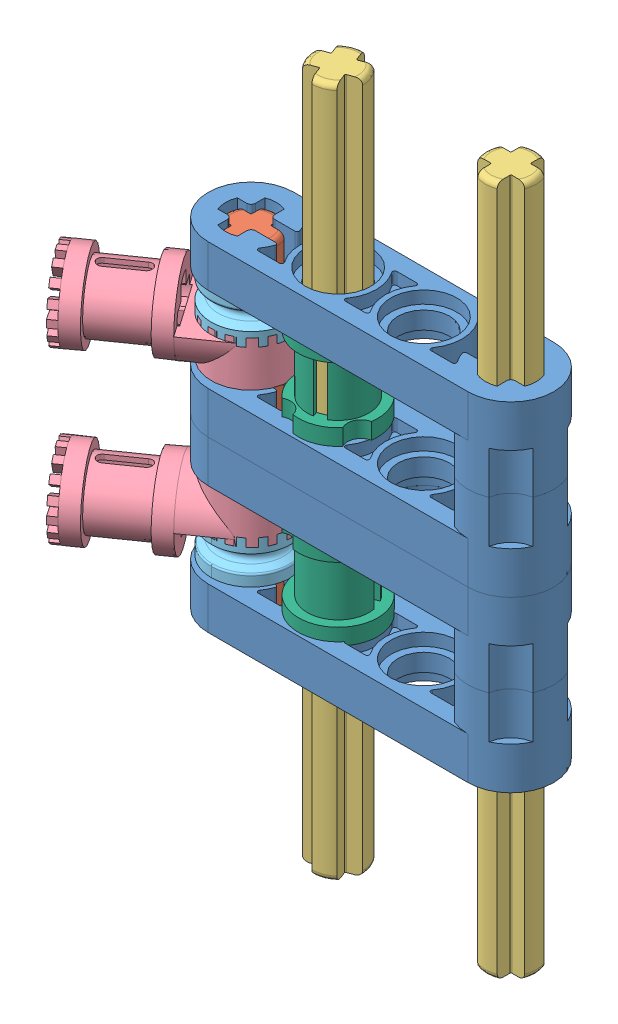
SolidWorks assembly Assem104.SLDASM, configuration Default (file format 4400). Lengths in mm.
Overall size (40.76 64.08 15.58).
13 component instances, 6 part files, 33 mates.
Components (placement in the parent):
- 4 rollbar Rood-1: 4 rollbar Rood.sldprt [Default] at (-6.7805 2.4232 3.2691) size (32 7.84 7.94)
- 4 rollbar Rood-2: 4 rollbar Rood.sldprt [Default] at (-6.7805 6.3232 3.2691) x (1 0 0) z (0 0 -1) size (32 7.84 7.94)
- 4 rollbar Rood-3: 4 rollbar Rood.sldprt [Default] at (-6.7805 18.0972 3.2691) size (32 7.84 7.94)
- 4 rollbar Rood-4: 4 rollbar Rood.sldprt [Default] at (-6.7805 -9.3508 3.2691) x (1 0 0) z (0 0 -1) size (32 7.84 7.94)
- Axle-30--1: Axle-30-.SLDPRT [Predeterminado] at (-18.8117 4.3732 3.2691) x (0 -1 0) z (-1 0 0) size (30.08 4.7 4.7)
- Axle-64--1: Axle-64-.SLDPRT [Predeterminado] at (5.2508 4.3732 3.2691) x (0 1 0) z (0 0 1) size (64.08 4.7 4.7)
- Axle-64--2: Axle-64-.SLDPRT [Predeterminado] at (-10.7492 4.3732 3.2691) x (0 1 0) z (-0.350642 0 -0.93651) size (64.08 4.7 4.7)
- HaakseBorgring Grijs-1: HaakseBorgring Grijs.sldprt [Default] at (-18.8117 12.9494 3.2691) x (-0.819152 0 0.573576) z (0.573576 0 0.819152) size (16.65 7.33 7.37)
- HaakseBorgring Grijs-2: HaakseBorgring Grijs.sldprt [Default] at (-18.8117 -3.8639 3.2691) x (-0.819152 0 0.573576) z (-0.573576 0 -0.819152) size (16.65 7.33 7.37)
- small collar-1: small collar.sldprt [Default] at (-18.8117 -3.1019 3.2691) x (0 0 -1) z (-1 0 0) size (7.37 3.94 7.37)
- small collar-2: small collar.sldprt [Default] at (-18.8117 12.1874 3.2691) x (-1 0 0) z (0 0 -1) size (7.37 3.94 7.37)
- Borgbus Grijs-3: Borgbus Grijs.SLDPRT [기본 설정] at (-10.7492 9.7732 3.2691) x (0.93651 0 -0.350642) z (0 -1 0) size (7.35 7.35 8.2)
- Borgbus Grijs-4: Borgbus Grijs.SLDPRT [기본 설정] at (-10.7492 -1.0268 3.2691) x (0.350642 0 0.93651) z (0 1 0) size (7.35 7.35 8.2)
Mates (geometry in assembly coordinates):
- Coincident1: coincident aligned: plane of 4 rollbar Rood-1 through (5.2508 4.3732 7.2378) normal (0 0 1); plane of 4 rollbar Rood-2 through (-18.8117 4.3732 7.2378) normal (0 0 1)
- Concentric1: concentric anti-aligned: cylinder of 4 rollbar Rood-1 through (5.2508 4.3732 3.2691) axis (0 -1 0) radius 3.9688; cylinder of 4 rollbar Rood-2 through (5.2508 4.3732 3.2691) axis (0 1 0) radius 3.9688
- Coincident2: coincident anti-aligned: plane of 4 rollbar Rood-1 through (5.2508 4.3732 3.2691) normal (0 1 0); plane of 4 rollbar Rood-2 through (5.2508 4.3732 3.2691) normal (0 -1 0)
- Coincident3: coincident aligned: plane of 4 rollbar Rood-2 through (-18.8117 4.3732 7.2378) normal (0 0 1); plane of 4 rollbar Rood-3 through (5.2508 20.0472 7.2378) normal (0 0 1)
- Concentric2: concentric anti-aligned: cylinder of 4 rollbar Rood-2 through (5.2508 4.3732 3.2691) axis (0 1 0) radius 3.9688; cylinder of 4 rollbar Rood-3 through (5.2508 20.0472 3.2691) axis (0 -1 0) radius 3.9688
- Coincident4: coincident anti-aligned: plane of 4 rollbar Rood-2 through (5.2508 12.2102 3.2691) normal (0 1 0); plane of 4 rollbar Rood-3 through (5.2508 12.2102 3.2691) normal (0 -1 0)
- Coincident5: coincident aligned: plane of 4 rollbar Rood-1 through (5.2508 4.3732 7.2378) normal (0 0 1); plane of 4 rollbar Rood-4 through (-18.8117 -11.3008 7.2378) normal (0 0 1)
- Concentric3: concentric anti-aligned: cylinder of 4 rollbar Rood-1 through (5.2508 4.3732 3.2691) axis (0 -1 0) radius 3.9688; cylinder of 4 rollbar Rood-4 through (5.2508 -11.3008 3.2691) axis (0 1 0) radius 3.9688
- Coincident6: coincident anti-aligned: plane of 4 rollbar Rood-1 through (5.2508 -3.4638 3.2691) normal (0 -1 0); plane of 4 rollbar Rood-4 through (5.2508 -3.4638 3.2691) normal (0 1 0)
- Concentric4: concentric aligned: cylinder of 4 rollbar Rood-3 through (-18.8117 16.1472 3.2691) axis (0 1 0) radius 2.35; cylinder of Axle-30--1 through (-18.8117 -10.6268 3.2691) axis (0 1 0) radius 2.35
- Coincident7: coincident anti-aligned: plane of 4 rollbar Rood-3 through (-19.7117 16.1472 1.0982) normal (1 0 0); plane of Axle-30--1 through (-19.7117 -10.6268 1.0982) normal (-1 0 0)
- Width1: width: plane of 4 rollbar Rood-3 through (5.2508 20.0472 3.2691) normal (0 1 0); plane of 4 rollbar Rood-4 through (5.2508 -11.3008 3.2691) normal (0 -1 0); plane of Axle-30--1 through (-18.8117 -10.6268 3.2691) normal (0 -1 0); plane of Axle-30--1 through (-18.8117 19.3732 3.2691) normal (0 1 0)
- Concentric5: concentric anti-aligned: cylinder of 4 rollbar Rood-3 through (5.2508 16.1472 3.2691) axis (0 1 0) radius 2.35; cylinder of Axle-64--1 through (5.2508 36.3732 3.2691) axis (0 -1 0) radius 2.35
- Coincident8: coincident anti-aligned: plane of 4 rollbar Rood-3 through (4.3508 16.1472 5.4399) normal (1 0 0); plane of Axle-64--1 through (4.3508 36.3732 5.4399) normal (-1 0 0)
- Width2: width: plane of 4 rollbar Rood-3 through (5.2508 20.0472 3.2691) normal (0 1 0); plane of 4 rollbar Rood-4 through (5.2508 -11.3008 3.2691) normal (0 -1 0); plane of Axle-64--1 through (5.2508 -27.6268 3.2691) normal (0 -1 0); plane of Axle-64--1 through (5.2508 36.3732 3.2691) normal (0 1 0)
- Concentric6: concentric anti-aligned: cylinder of 4 rollbar Rood-3 through (-10.7492 16.1472 3.2691) axis (0 1 0) radius 2.3876; cylinder of Axle-64--2 through (-10.7492 36.3732 3.2691) axis (0 -1 0) radius 2.35
- Width3: width: plane of 4 rollbar Rood-3 through (5.2508 20.0472 3.2691) normal (0 1 0); plane of 4 rollbar Rood-4 through (5.2508 -11.3008 3.2691) normal (0 -1 0); plane of Axle-64--2 through (-10.7492 -27.6268 3.2691) normal (0 -1 0); plane of Axle-64--2 through (-10.7492 36.3732 3.2691) normal (0 1 0)
- Concentric7: concentric aligned: cylinder of Axle-64--2 through (-10.7492 36.3732 3.2691) axis (0 -1 0) radius 2.35; cylinder of Borgbus Grijs-3 through (-10.7492 16.4732 3.2691) axis (0 -1 0) radius 3.675
- Coincident12: coincident anti-aligned: plane of Axle-64--2 through (-12.3533 36.3732 1.5516) normal (-0.93651 0 0.350642); plane of Borgbus Grijs-3 through (-11.9077 17.2732 2.7418) normal (0.93651 0 -0.350642)
- Coincident13: coincident anti-aligned: plane of 4 rollbar Rood-2 through (5.2508 8.2732 3.2691) normal (0 1 0); plane of Borgbus Grijs-3 through (-10.7492 8.2732 3.2691) normal (0 -1 0)
- Concentric8: concentric anti-aligned: cylinder of Axle-64--2 through (-10.7492 36.3732 3.2691) axis (0 -1 0) radius 2.35; cylinder of Borgbus Grijs-4 through (-10.7492 -7.7268 3.2691) axis (0 1 0) radius 3.675
- Coincident14: coincident anti-aligned: plane of Axle-64--2 through (-9.1452 36.3732 4.9865) normal (0.93651 0 -0.350642); plane of Borgbus Grijs-4 through (-9.5908 -8.5268 3.7964) normal (-0.93651 0 0.350642)
- Coincident16: coincident anti-aligned: plane of 4 rollbar Rood-1 through (5.2508 0.4732 3.2691) normal (0 -1 0); plane of Borgbus Grijs-4 through (-10.7492 0.4732 3.2691) normal (0 1 0)
- Concentric9: concentric anti-aligned: cylinder of Axle-30--1 through (-18.8117 -10.6268 3.2691) axis (0 1 0) radius 2.35; cylinder of HaakseBorgring Grijs-1 through (-18.8117 16.0826 3.2691) axis (0 -1 0) radius 2.4
- Concentric10: concentric aligned: cylinder of Axle-30--1 through (-18.8117 -10.6268 3.2691) axis (0 1 0) radius 2.35; cylinder of HaakseBorgring Grijs-2 through (-18.8117 -6.997 3.2691) axis (0 1 0) radius 2.4
- Concentric11: concentric aligned: cylinder of Axle-30--1 through (-18.8117 -10.6268 3.2691) axis (0 1 0) radius 2.35; cylinder of small collar-2 through (-18.8117 12.1864 3.2691) axis (0 1 0) radius 2.4
- Coincident19: coincident anti-aligned: plane of Axle-30--1 through (-17.9117 -10.6268 5.4399) normal (1 0 0); plane of small collar-2 through (-17.9117 13.0764 5.4939) normal (-1 0 0)
- Parallel1: parallel aligned: plane of HaakseBorgring Grijs-1 through (-24.7606 16.7034 6.8316) normal (0.573576 0 0.819152); plane of HaakseBorgring Grijs-2 through (-24.7677 -7.6179 6.8216) normal (0.573576 0 0.819152)
- Concentric12: concentric anti-aligned: cylinder of Axle-30--1 through (-18.8117 -10.6268 3.2691) axis (0 1 0) radius 2.35; cylinder of small collar-1 through (-18.8117 -3.1009 3.2691) axis (0 -1 0) radius 2.4
- Coincident25: coincident anti-aligned: plane of Axle-30--1 through (-20.9826 -10.6268 2.3691) normal (0 0 -1); plane of small collar-1 through (-19.7117 -3.9909 2.3691) normal (0 0 1)
- Coincident30: coincident anti-aligned: plane of HaakseBorgring Grijs-2 through (-18.8117 -3.1019 3.2691) normal (0 -1 0); plane of small collar-1 through (-18.8117 -3.1019 3.2691) normal (0 1 0)
- Coincident33: coincident anti-aligned: plane of HaakseBorgring Grijs-1 through (-18.8117 12.9494 3.2691) normal (0 1 0); plane of small collar-2 through (-18.8117 12.9494 3.2691) normal (0 -1 0)
- Coincident34: coincident anti-aligned: plane of HaakseBorgring Grijs-2 through (-17.3012 -3.1019 5.0693) normal (-0.766044 0 0.642788); plane of small collar-1 through (-17.277 -3.8639 5.0981) normal (0.766044 0 -0.642788)
